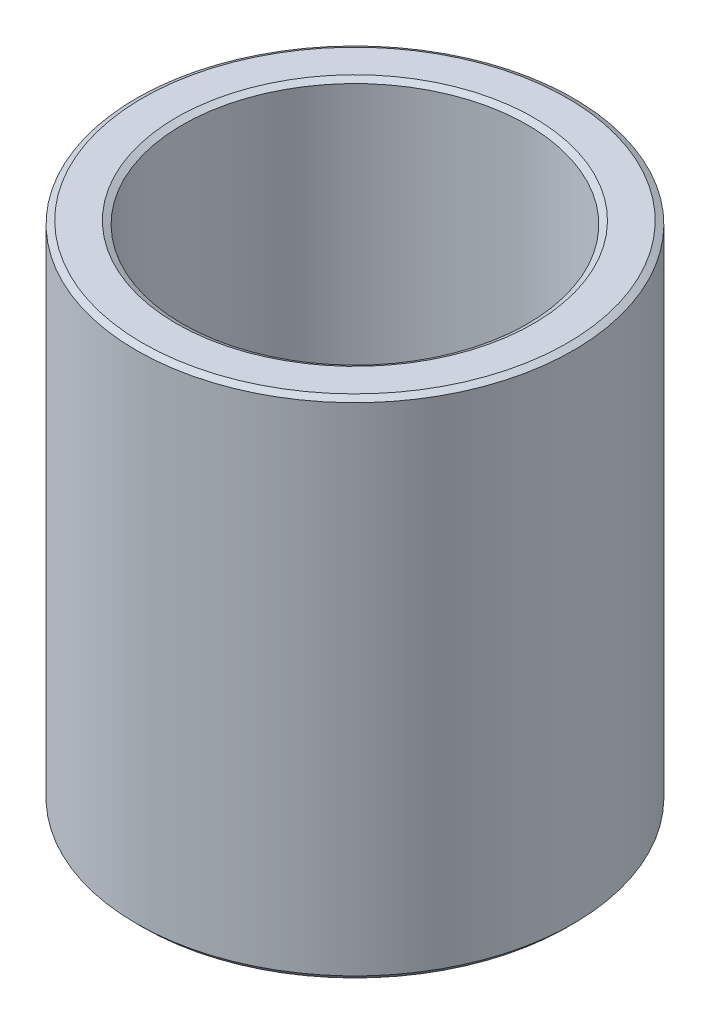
ISO-10303-21;
HEADER;
FILE_DESCRIPTION(('STEP AP214'),'2;1');
FILE_NAME('part.step','',(''),(''),'','','');
FILE_SCHEMA(('AUTOMOTIVE_DESIGN { 1 0 10303 214 1 1 1 1 }'));
ENDSEC;
DATA;
#1=APPLICATION_CONTEXT('core data for automotive mechanical design processes');
#2=APPLICATION_PROTOCOL_DEFINITION('international standard','automotive_design',2000,#1);
#3=PRODUCT_CONTEXT('',#1,'mechanical');
#4=PRODUCT('Part','Part','',(#3));
#5=PRODUCT_RELATED_PRODUCT_CATEGORY('part','',(#4));
#6=PRODUCT_DEFINITION_FORMATION('','',#4);
#7=PRODUCT_DEFINITION_CONTEXT('part definition',#1,'design');
#8=PRODUCT_DEFINITION('design','',#6,#7);
#9=PRODUCT_DEFINITION_SHAPE('','',#8);
#10=(LENGTH_UNIT() NAMED_UNIT(*) SI_UNIT(.MILLI.,.METRE.));
#11=(NAMED_UNIT(*) PLANE_ANGLE_UNIT() SI_UNIT($,.RADIAN.));
#12=(NAMED_UNIT(*) SI_UNIT($,.STERADIAN.) SOLID_ANGLE_UNIT());
#13=UNCERTAINTY_MEASURE_WITH_UNIT(LENGTH_MEASURE(1.E-05),#10,'distance_accuracy_value','');
#14=(GEOMETRIC_REPRESENTATION_CONTEXT(3) GLOBAL_UNCERTAINTY_ASSIGNED_CONTEXT((#13)) GLOBAL_UNIT_ASSIGNED_CONTEXT((#10,
#11,#12)) REPRESENTATION_CONTEXT('',''));
#15=CARTESIAN_POINT('',(0.,0.,0.));
#16=DIRECTION('',(0.,0.,1.));
#17=DIRECTION('',(1.,0.,0.));
#18=AXIS2_PLACEMENT_3D('',#15,#16,#17);
#19=CARTESIAN_POINT('',(9.73333333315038,0.,0.));
#20=DIRECTION('',(0.,-1.,0.));
#21=DIRECTION('',(0.,0.,-1.));
#22=AXIS2_PLACEMENT_3D('',#19,#20,#21);
#23=PLANE('',#22);
#24=CARTESIAN_POINT('',(0.49999999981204,0.,0.));
#25=DIRECTION('',(0.,1.,0.));
#26=DIRECTION('',(0.,0.,1.));
#27=AXIS2_PLACEMENT_3D('',#24,#25,#26);
#28=CIRCLE('',#27,7.76666666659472);
#29=CARTESIAN_POINT('',(0.49999999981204,0.,7.76666666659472));
#30=VERTEX_POINT('',#29);
#31=EDGE_CURVE('E10',#30,#30,#28,.T.);
#32=ORIENTED_EDGE('',*,*,#31,.T.);
#33=EDGE_LOOP('',(#32));
#34=FACE_BOUND('',#33,.T.);
#35=CARTESIAN_POINT('',(0.49999999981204,0.,0.));
#36=DIRECTION('',(0.,1.,0.));
#37=DIRECTION('',(0.,0.,1.));
#38=AXIS2_PLACEMENT_3D('',#35,#36,#37);
#39=CIRCLE('',#38,9.23333333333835);
#40=CARTESIAN_POINT('',(0.49999999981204,0.,9.23333333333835));
#41=VERTEX_POINT('',#40);
#42=EDGE_CURVE('E58',#41,#41,#39,.T.);
#43=ORIENTED_EDGE('',*,*,#42,.F.);
#44=EDGE_LOOP('',(#43));
#45=FACE_BOUND('',#44,.T.);
#46=ADVANCED_FACE('F30',(#34,#45),#23,.T.);
#47=CARTESIAN_POINT('',(0.49999999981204,0.,0.));
#48=DIRECTION('',(0.,-1.,0.));
#49=DIRECTION('',(0.,0.,-1.));
#50=AXIS2_PLACEMENT_3D('',#47,#48,#49);
#51=CONICAL_SURFACE('',#50,7.76666666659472,0.785398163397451);
#52=CARTESIAN_POINT('',(0.49999999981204,0.266666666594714,0.));
#53=DIRECTION('',(0.,1.,0.));
#54=DIRECTION('',(0.,0.,1.));
#55=AXIS2_PLACEMENT_3D('',#52,#53,#54);
#56=CIRCLE('',#55,7.5);
#57=CARTESIAN_POINT('',(0.49999999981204,0.266666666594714,7.5));
#58=VERTEX_POINT('',#57);
#59=EDGE_CURVE('E36',#58,#58,#56,.T.);
#60=ORIENTED_EDGE('',*,*,#59,.T.);
#61=EDGE_LOOP('',(#60));
#62=FACE_BOUND('',#61,.T.);
#63=ORIENTED_EDGE('',*,*,#31,.F.);
#64=EDGE_LOOP('',(#63));
#65=FACE_BOUND('',#64,.T.);
#66=ADVANCED_FACE('F66',(#62,#65),#51,.F.);
#67=CARTESIAN_POINT('',(0.49999999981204,0.,0.));
#68=DIRECTION('',(0.,1.,0.));
#69=DIRECTION('',(0.,0.,1.));
#70=AXIS2_PLACEMENT_3D('',#67,#68,#69);
#71=CYLINDRICAL_SURFACE('',#70,7.5);
#72=CARTESIAN_POINT('',(0.49999999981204,21.8566666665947,0.));
#73=DIRECTION('',(0.,1.,0.));
#74=DIRECTION('',(0.,0.,1.));
#75=AXIS2_PLACEMENT_3D('',#72,#73,#74);
#76=CIRCLE('',#75,7.50000000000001);
#77=CARTESIAN_POINT('',(0.49999999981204,21.8566666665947,7.50000000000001));
#78=VERTEX_POINT('',#77);
#79=EDGE_CURVE('E40',#78,#78,#76,.T.);
#80=ORIENTED_EDGE('',*,*,#79,.T.);
#81=EDGE_LOOP('',(#80));
#82=FACE_BOUND('',#81,.T.);
#83=ORIENTED_EDGE('',*,*,#59,.F.);
#84=EDGE_LOOP('',(#83));
#85=FACE_BOUND('',#84,.T.);
#86=ADVANCED_FACE('F70',(#82,#85),#71,.F.);
#87=CARTESIAN_POINT('',(0.49999999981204,21.8566666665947,0.));
#88=DIRECTION('',(0.,1.,0.));
#89=DIRECTION('',(0.,0.,1.));
#90=AXIS2_PLACEMENT_3D('',#87,#88,#89);
#91=CONICAL_SURFACE('',#90,7.50000000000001,1.07760066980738);
#92=CARTESIAN_POINT('',(0.49999999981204,22.,0.));
#93=DIRECTION('',(0.,1.,0.));
#94=DIRECTION('',(0.,0.,1.));
#95=AXIS2_PLACEMENT_3D('',#92,#93,#94);
#96=CIRCLE('',#95,7.7666666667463);
#97=CARTESIAN_POINT('',(0.49999999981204,22.,7.7666666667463));
#98=VERTEX_POINT('',#97);
#99=EDGE_CURVE('E44',#98,#98,#96,.T.);
#100=ORIENTED_EDGE('',*,*,#99,.T.);
#101=EDGE_LOOP('',(#100));
#102=FACE_BOUND('',#101,.T.);
#103=ORIENTED_EDGE('',*,*,#79,.F.);
#104=EDGE_LOOP('',(#103));
#105=FACE_BOUND('',#104,.T.);
#106=ADVANCED_FACE('F74',(#102,#105),#91,.F.);
#107=CARTESIAN_POINT('',(8.26666666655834,22.,0.));
#108=DIRECTION('',(0.,1.,0.));
#109=DIRECTION('',(0.,0.,1.));
#110=AXIS2_PLACEMENT_3D('',#107,#108,#109);
#111=PLANE('',#110);
#112=CARTESIAN_POINT('',(0.49999999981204,22.,0.));
#113=DIRECTION('',(0.,1.,0.));
#114=DIRECTION('',(0.,0.,1.));
#115=AXIS2_PLACEMENT_3D('',#112,#113,#114);
#116=CIRCLE('',#115,9.23333333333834);
#117=CARTESIAN_POINT('',(0.49999999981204,22.,9.23333333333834));
#118=VERTEX_POINT('',#117);
#119=EDGE_CURVE('E49',#118,#118,#116,.T.);
#120=ORIENTED_EDGE('',*,*,#119,.T.);
#121=EDGE_LOOP('',(#120));
#122=FACE_BOUND('',#121,.T.);
#123=ORIENTED_EDGE('',*,*,#99,.F.);
#124=EDGE_LOOP('',(#123));
#125=FACE_BOUND('',#124,.T.);
#126=ADVANCED_FACE('F81',(#122,#125),#111,.T.);
#127=CARTESIAN_POINT('',(0.49999999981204,22.,0.));
#128=DIRECTION('',(0.,-1.,0.));
#129=DIRECTION('',(0.,0.,-1.));
#130=AXIS2_PLACEMENT_3D('',#127,#128,#129);
#131=CONICAL_SURFACE('',#130,9.23333333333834,1.07760066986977);
#132=CARTESIAN_POINT('',(0.49999999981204,21.8566666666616,0.));
#133=DIRECTION('',(0.,1.,0.));
#134=DIRECTION('',(0.,0.,1.));
#135=AXIS2_PLACEMENT_3D('',#132,#133,#134);
#136=CIRCLE('',#135,9.5);
#137=CARTESIAN_POINT('',(0.49999999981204,21.8566666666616,9.5));
#138=VERTEX_POINT('',#137);
#139=EDGE_CURVE('E52',#138,#138,#136,.T.);
#140=ORIENTED_EDGE('',*,*,#139,.T.);
#141=EDGE_LOOP('',(#140));
#142=FACE_BOUND('',#141,.T.);
#143=ORIENTED_EDGE('',*,*,#119,.F.);
#144=EDGE_LOOP('',(#143));
#145=FACE_BOUND('',#144,.T.);
#146=ADVANCED_FACE('F85',(#142,#145),#131,.T.);
#147=CARTESIAN_POINT('',(0.49999999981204,0.,0.));
#148=DIRECTION('',(0.,1.,0.));
#149=DIRECTION('',(0.,0.,1.));
#150=AXIS2_PLACEMENT_3D('',#147,#148,#149);
#151=CYLINDRICAL_SURFACE('',#150,9.5);
#152=CARTESIAN_POINT('',(0.49999999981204,0.266666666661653,0.));
#153=DIRECTION('',(0.,1.,0.));
#154=DIRECTION('',(0.,0.,1.));
#155=AXIS2_PLACEMENT_3D('',#152,#153,#154);
#156=CIRCLE('',#155,9.5);
#157=CARTESIAN_POINT('',(0.49999999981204,0.266666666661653,9.5));
#158=VERTEX_POINT('',#157);
#159=EDGE_CURVE('E55',#158,#158,#156,.T.);
#160=ORIENTED_EDGE('',*,*,#159,.T.);
#161=EDGE_LOOP('',(#160));
#162=FACE_BOUND('',#161,.T.);
#163=ORIENTED_EDGE('',*,*,#139,.F.);
#164=EDGE_LOOP('',(#163));
#165=FACE_BOUND('',#164,.T.);
#166=ADVANCED_FACE('F89',(#162,#165),#151,.T.);
#167=CARTESIAN_POINT('',(0.49999999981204,0.266666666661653,0.));
#168=DIRECTION('',(0.,1.,0.));
#169=DIRECTION('',(0.,0.,1.));
#170=AXIS2_PLACEMENT_3D('',#167,#168,#169);
#171=CONICAL_SURFACE('',#170,9.5,0.785398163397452);
#172=ORIENTED_EDGE('',*,*,#42,.T.);
#173=EDGE_LOOP('',(#172));
#174=FACE_BOUND('',#173,.T.);
#175=ORIENTED_EDGE('',*,*,#159,.F.);
#176=EDGE_LOOP('',(#175));
#177=FACE_BOUND('',#176,.T.);
#178=ADVANCED_FACE('F62',(#174,#177),#171,.T.);
#179=CLOSED_SHELL('',(#46,#66,#86,#106,#126,#146,#166,#178));
#180=MANIFOLD_SOLID_BREP('B2',#179);
#181=ADVANCED_BREP_SHAPE_REPRESENTATION('',(#18,#180),#14);
#182=SHAPE_DEFINITION_REPRESENTATION(#9,#181);
ENDSEC;
END-ISO-10303-21;
